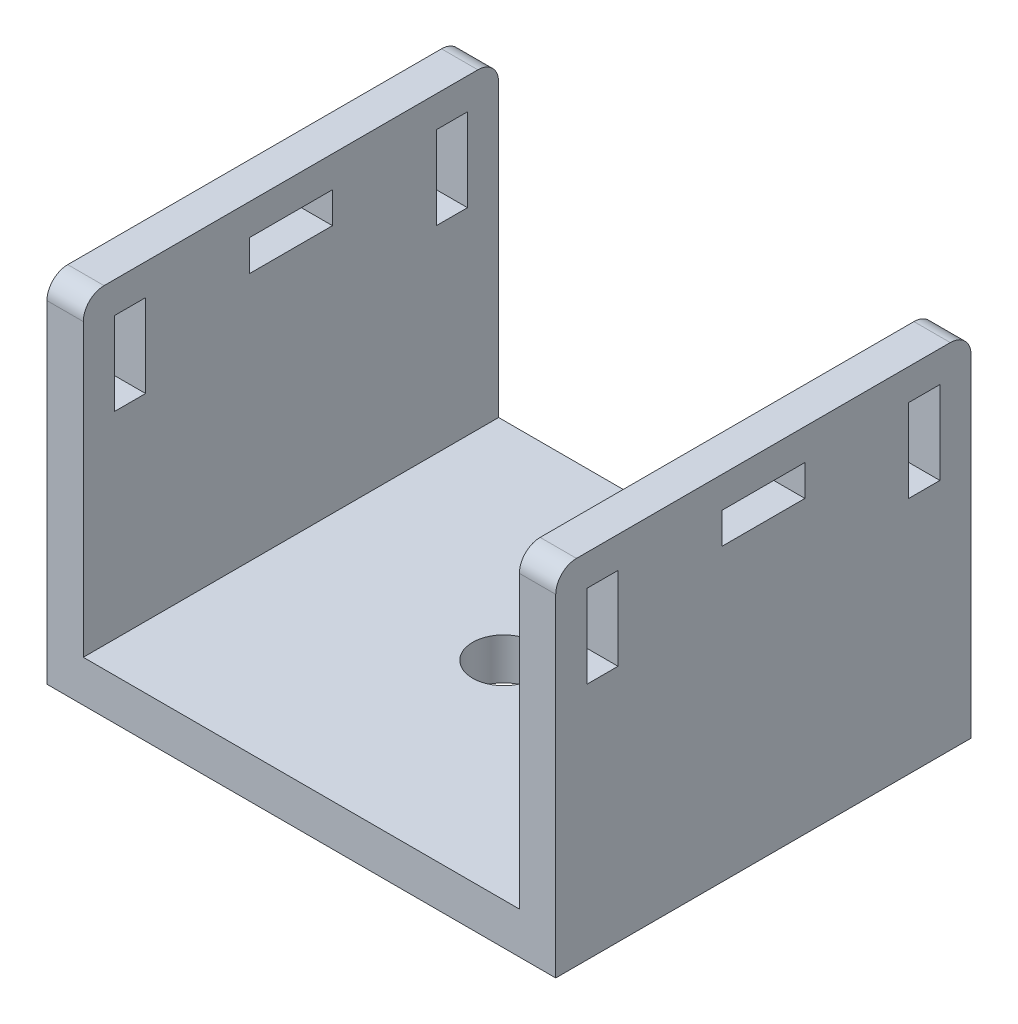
from build123d import *

# Parameters (mm, degrees)
BOSS_EXTRU_1_DEPTH      = 20
ESQUISSE2_W             = 4
ESQUISSE2_H             = 1.5
ESQUISSE2_W_2           = 1.5
ESQUISSE2_H_2           = 4
ENL_V_MAT_EXTRU_1_DEPTH = 30
ESQUISSE3_R             = 1.5
ENL_V_MAT_EXTRU_2_DEPTH = 30
CONG_1_R                = 1


with BuildPart() as part:
    # Esquisse1 → Boss.-Extru.1 (new body)
    with BuildSketch(Plane.XY):
        Polygon((0, 17), (0, 0), (24.5, 0), (24.5, 17), (22.75, 17), (22.75, 2), (1.75, 2), (1.75, 17), align=None)
    extrude(amount=BOSS_EXTRU_1_DEPTH)

    # Esquisse2 → Enl_v. mat.-Extru.1 (cut)
    with BuildSketch(Plane(origin=(24.5, 0, 0), x_dir=(0, 0, -1), z_dir=(1, 0, 0))):
        with Locations((-10, 14.75)):
            Rectangle(ESQUISSE2_W, ESQUISSE2_H)
        with Locations((-17.75, 13.5)):
            Rectangle(ESQUISSE2_W_2, ESQUISSE2_H_2)
        with Locations((-2.25, 13.5)):
            Rectangle(ESQUISSE2_W_2, ESQUISSE2_H_2)
    extrude(amount=-ENL_V_MAT_EXTRU_1_DEPTH, mode=Mode.SUBTRACT)

    # Esquisse3 → Enl_v. mat.-Extru.2 (cut)
    with BuildSketch(Plane(origin=(0, 2, 0), x_dir=(1, 0, 0), z_dir=(0, 1, 0))):
        with Locations(Location((12, -10, 0), (0, 0, 180))):
            Circle(ESQUISSE3_R)
    extrude(amount=-ENL_V_MAT_EXTRU_2_DEPTH, mode=Mode.SUBTRACT)

    # Cong_1
    cong_1_edges = [part.edges().sort_by_distance(p)[0] for p in [
        (0.875, 17, 0),
        (23.625, 17, 20),
        (0.875, 17, 20),
        (23.625, 17, 0),
    ]]
    fillet(cong_1_edges, radius=CONG_1_R)


solid = part.part
